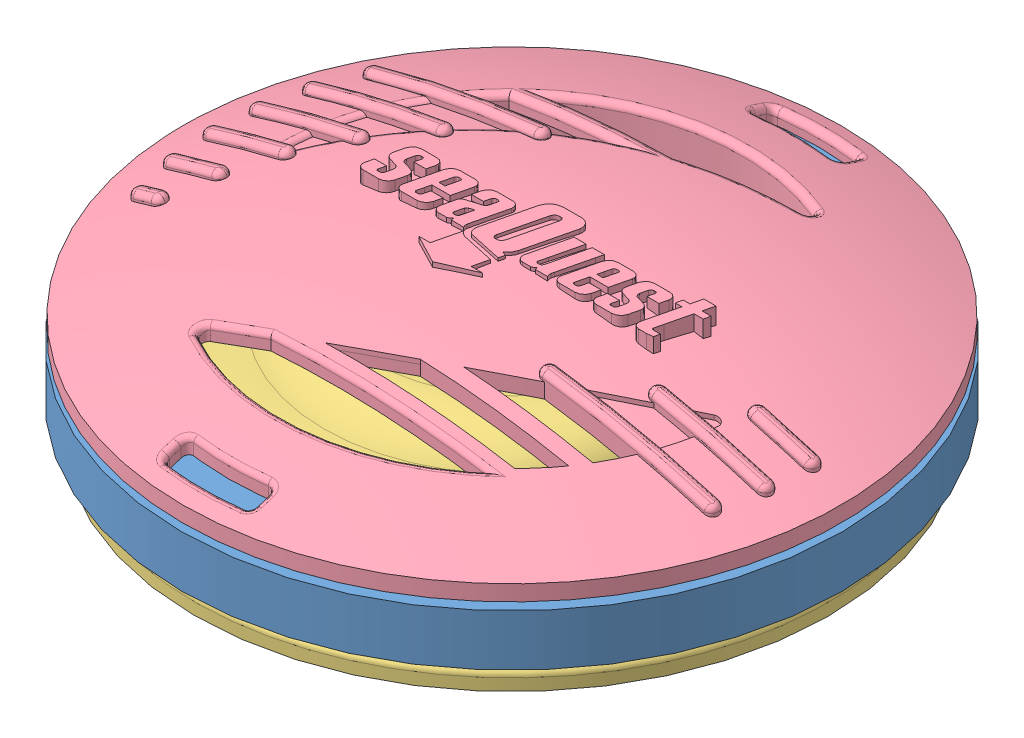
SolidWorks assembly Diaphram.SLDASM, configuration Default (file format 3100). Lengths in mm.
Overall size (75.74 14.1 75.74).
4 component instances, 4 part files, 10 mates.
Components (placement in the parent):
- DiaphramRetainer-1: DiaphramRetainer.SLDPRT [Default] at origin size (57.15 4.45 57.15)
- DiaphramRing-1: DiaphramRing.SLDPRT [Default] at (0 -4.445 0) x (1 0 0) z (0 -1 0) size (54.36 54.36 0.76)
- Diaphram-1: Diaphram.SLDPRT [Default] at (0 -5.207 0) x (0 1 0) z (0.536779 0 0.843723) size (11.06 54.86 54.86)
- DiaphramCover-1: DiaphramCover.SLDPRT [Default] at (0 6.985 0) x (1 0 0) z (0 1 0) size (56.9 56.9 11.18)
Mates (geometry in assembly coordinates):
- MateCoincident1: coincident aligned: plane of DiaphramRetainer-1; plane of assembly
- MateCoincident2: coincident aligned: plane of DiaphramRetainer-1; plane of assembly
- MateCoincident3: coincident aligned: plane of DiaphramRetainer-1; plane of assembly
- MateCoincident4: coincident: plane of DiaphramRetainer-1; plane of DiaphramRing-1
- MateConcentric1: concentric anti-aligned: cylinder of DiaphramRetainer-1; cylinder of DiaphramRing-1
- MateConcentric2: concentric anti-aligned: cylinder of DiaphramRetainer-1; cylinder of Diaphram-1
- MateCoincident5: coincident: plane of DiaphramRing-1; plane of Diaphram-1
- MateParallel1: parallel anti-aligned: plane of DiaphramCover-1; plane of assembly
- MateConcentric3: concentric anti-aligned: cylinder of DiaphramRetainer-1; cylinder of DiaphramCover-1
- MateCoincident6: coincident: plane of DiaphramRetainer-1; plane of DiaphramCover-1
